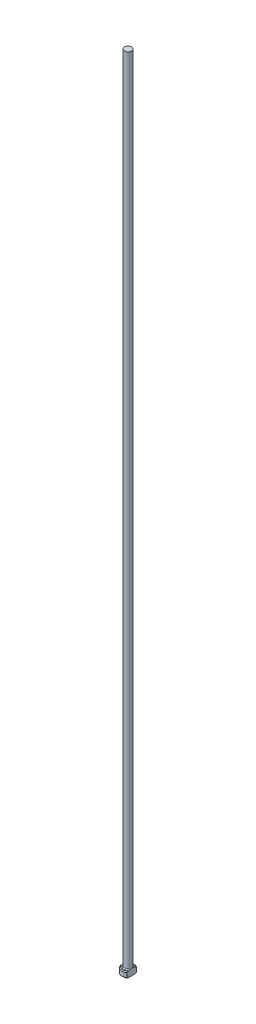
ISO-10303-21;
HEADER;
FILE_DESCRIPTION(('STEP AP214'),'2;1');
FILE_NAME('part.step','',(''),(''),'','','');
FILE_SCHEMA(('AUTOMOTIVE_DESIGN { 1 0 10303 214 1 1 1 1 }'));
ENDSEC;
DATA;
#1=APPLICATION_CONTEXT('core data for automotive mechanical design processes');
#2=APPLICATION_PROTOCOL_DEFINITION('international standard','automotive_design',2000,#1);
#3=PRODUCT_CONTEXT('',#1,'mechanical');
#4=PRODUCT('Part','Part','',(#3));
#5=PRODUCT_RELATED_PRODUCT_CATEGORY('part','',(#4));
#6=PRODUCT_DEFINITION_FORMATION('','',#4);
#7=PRODUCT_DEFINITION_CONTEXT('part definition',#1,'design');
#8=PRODUCT_DEFINITION('design','',#6,#7);
#9=PRODUCT_DEFINITION_SHAPE('','',#8);
#10=(LENGTH_UNIT() NAMED_UNIT(*) SI_UNIT(.MILLI.,.METRE.));
#11=(NAMED_UNIT(*) PLANE_ANGLE_UNIT() SI_UNIT($,.RADIAN.));
#12=(NAMED_UNIT(*) SI_UNIT($,.STERADIAN.) SOLID_ANGLE_UNIT());
#13=UNCERTAINTY_MEASURE_WITH_UNIT(LENGTH_MEASURE(1.E-05),#10,'distance_accuracy_value','');
#14=(GEOMETRIC_REPRESENTATION_CONTEXT(3) GLOBAL_UNCERTAINTY_ASSIGNED_CONTEXT((#13)) GLOBAL_UNIT_ASSIGNED_CONTEXT((#10,
#11,#12)) REPRESENTATION_CONTEXT('',''));
#15=CARTESIAN_POINT('',(0.,0.,0.));
#16=DIRECTION('',(0.,0.,1.));
#17=DIRECTION('',(1.,0.,0.));
#18=AXIS2_PLACEMENT_3D('',#15,#16,#17);
#19=CARTESIAN_POINT('',(0.,0.,0.));
#20=DIRECTION('',(0.,-1.,0.));
#21=DIRECTION('',(0.,0.,-1.));
#22=AXIS2_PLACEMENT_3D('',#19,#20,#21);
#23=PLANE('',#22);
#24=CARTESIAN_POINT('',(0.,0.,0.));
#25=DIRECTION('',(0.,-1.,0.));
#26=DIRECTION('',(0.,0.,-1.));
#27=AXIS2_PLACEMENT_3D('',#24,#25,#26);
#28=CIRCLE('',#27,1.29999999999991);
#29=CARTESIAN_POINT('',(0.899999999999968,0.,0.938083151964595));
#30=VERTEX_POINT('',#29);
#31=CARTESIAN_POINT('',(0.899999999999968,0.,-0.938083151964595));
#32=VERTEX_POINT('',#31);
#33=EDGE_CURVE('E98',#30,#32,#28,.T.);
#34=ORIENTED_EDGE('',*,*,#33,.T.);
#35=DIRECTION('',(0.,0.,1.));
#36=VECTOR('',#35,1.);
#37=CARTESIAN_POINT('',(0.899999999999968,0.,-1.19999999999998));
#38=LINE('',#37,#36);
#39=EDGE_CURVE('E83',#32,#30,#38,.T.);
#40=ORIENTED_EDGE('',*,*,#39,.T.);
#41=EDGE_LOOP('',(#34,#40));
#42=FACE_BOUND('',#41,.T.);
#43=ADVANCED_FACE('F32',(#42),#23,.T.);
#44=CARTESIAN_POINT('',(0.,259.958771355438,0.));
#45=DIRECTION('',(0.,1.,0.));
#46=DIRECTION('',(0.,0.,1.));
#47=AXIS2_PLACEMENT_3D('',#44,#45,#46);
#48=CYLINDRICAL_SURFACE('',#47,1.49999999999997);
#49=CARTESIAN_POINT('',(0.,1.30000000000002,0.));
#50=DIRECTION('',(0.,1.,0.));
#51=DIRECTION('',(0.,0.,1.));
#52=AXIS2_PLACEMENT_3D('',#49,#50,#51);
#53=CIRCLE('',#52,1.49999999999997);
#54=CARTESIAN_POINT('',(0.899999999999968,1.30000000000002,1.19999999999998));
#55=VERTEX_POINT('',#54);
#56=CARTESIAN_POINT('',(0.899999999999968,1.30000000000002,-1.19999999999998));
#57=VERTEX_POINT('',#56);
#58=EDGE_CURVE('E104',#55,#57,#53,.F.);
#59=ORIENTED_EDGE('',*,*,#58,.T.);
#60=DIRECTION('',(0.,-1.,0.));
#61=VECTOR('',#60,1.);
#62=CARTESIAN_POINT('',(0.899999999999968,200.,-1.19999999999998));
#63=LINE('',#62,#61);
#64=CARTESIAN_POINT('',(0.899999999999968,0.200000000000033,-1.19999999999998));
#65=VERTEX_POINT('',#64);
#66=EDGE_CURVE('E183',#57,#65,#63,.T.);
#67=ORIENTED_EDGE('',*,*,#66,.T.);
#68=CARTESIAN_POINT('',(0.,0.200000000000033,0.));
#69=DIRECTION('',(0.,-1.,0.));
#70=DIRECTION('',(0.,0.,-1.));
#71=AXIS2_PLACEMENT_3D('',#68,#69,#70);
#72=CIRCLE('',#71,1.49999999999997);
#73=CARTESIAN_POINT('',(0.899999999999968,0.200000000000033,1.19999999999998));
#74=VERTEX_POINT('',#73);
#75=EDGE_CURVE('E100',#65,#74,#72,.F.);
#76=ORIENTED_EDGE('',*,*,#75,.T.);
#77=DIRECTION('',(0.,-1.,0.));
#78=VECTOR('',#77,1.);
#79=CARTESIAN_POINT('',(0.899999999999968,200.,1.19999999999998));
#80=LINE('',#79,#78);
#81=EDGE_CURVE('E93',#55,#74,#80,.T.);
#82=ORIENTED_EDGE('',*,*,#81,.F.);
#83=EDGE_LOOP('',(#59,#67,#76,#82));
#84=FACE_BOUND('',#83,.T.);
#85=ADVANCED_FACE('F158',(#84),#48,.T.);
#86=CARTESIAN_POINT('',(-1.49999999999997,1.5,0.));
#87=DIRECTION('',(0.,1.,0.));
#88=DIRECTION('',(0.,0.,1.));
#89=AXIS2_PLACEMENT_3D('',#86,#87,#88);
#90=PLANE('',#89);
#91=CARTESIAN_POINT('',(0.,1.5,0.));
#92=DIRECTION('',(0.,1.,0.));
#93=DIRECTION('',(0.,0.,1.));
#94=AXIS2_PLACEMENT_3D('',#91,#92,#93);
#95=CIRCLE('',#94,1.30000000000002);
#96=CARTESIAN_POINT('',(0.899999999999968,1.5,-0.938083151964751));
#97=VERTEX_POINT('',#96);
#98=CARTESIAN_POINT('',(0.899999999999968,1.5,0.938083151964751));
#99=VERTEX_POINT('',#98);
#100=EDGE_CURVE('E178',#97,#99,#95,.T.);
#101=ORIENTED_EDGE('',*,*,#100,.T.);
#102=DIRECTION('',(0.,0.,-1.));
#103=VECTOR('',#102,1.);
#104=CARTESIAN_POINT('',(0.899999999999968,1.5,0.));
#105=LINE('',#104,#103);
#106=CARTESIAN_POINT('',(0.899999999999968,1.49999999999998,0.632455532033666));
#107=VERTEX_POINT('',#106);
#108=EDGE_CURVE('E57',#99,#107,#105,.T.);
#109=ORIENTED_EDGE('',*,*,#108,.T.);
#110=CARTESIAN_POINT('',(0.,1.5,0.));
#111=DIRECTION('',(0.,1.,0.));
#112=DIRECTION('',(0.,0.,1.));
#113=AXIS2_PLACEMENT_3D('',#110,#111,#112);
#114=CIRCLE('',#113,1.09999999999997);
#115=CARTESIAN_POINT('',(0.899999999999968,1.49999999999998,-0.632455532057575));
#116=VERTEX_POINT('',#115);
#117=EDGE_CURVE('E107',#107,#116,#114,.F.);
#118=ORIENTED_EDGE('',*,*,#117,.T.);
#119=EDGE_CURVE('E136',#116,#97,#105,.T.);
#120=ORIENTED_EDGE('',*,*,#119,.T.);
#121=EDGE_LOOP('',(#101,#109,#118,#120));
#122=FACE_BOUND('',#121,.T.);
#123=ADVANCED_FACE('F147',(#122),#90,.T.);
#124=CARTESIAN_POINT('',(0.,1.5,0.));
#125=DIRECTION('',(0.,-1.,0.));
#126=DIRECTION('',(0.,0.,-1.));
#127=AXIS2_PLACEMENT_3D('',#124,#125,#126);
#128=CONICAL_SURFACE('',#127,1.30000000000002,0.785398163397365);
#129=ORIENTED_EDGE('',*,*,#58,.F.);
#130=CARTESIAN_POINT('',(0.899999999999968,0.00589240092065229,2.64519134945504));
#131=CARTESIAN_POINT('',(0.899999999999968,0.0875935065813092,2.55886544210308));
#132=CARTESIAN_POINT('',(0.899999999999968,0.169100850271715,2.47235390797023));
#133=CARTESIAN_POINT('',(0.899999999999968,0.331616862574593,2.29867113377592));
#134=CARTESIAN_POINT('',(0.899999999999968,0.412624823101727,2.21149923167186));
#135=CARTESIAN_POINT('',(0.899999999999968,0.577358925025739,2.03258511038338));
#136=CARTESIAN_POINT('',(0.899999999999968,0.661049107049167,1.94080967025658));
#137=CARTESIAN_POINT('',(0.899999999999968,0.827038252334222,1.75619257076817));
#138=CARTESIAN_POINT('',(0.899999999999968,0.909338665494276,1.66335221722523));
#139=CARTESIAN_POINT('',(0.899999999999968,1.0718306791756,1.47606416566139));
#140=CARTESIAN_POINT('',(0.899999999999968,1.15202519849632,1.38161902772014));
#141=CARTESIAN_POINT('',(0.899999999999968,1.26992152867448,1.23769406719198));
#142=CARTESIAN_POINT('',(0.899999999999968,1.30888905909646,1.18925359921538));
#143=CARTESIAN_POINT('',(0.899999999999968,1.38565831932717,1.09146009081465));
#144=CARTESIAN_POINT('',(0.899999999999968,1.42346015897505,1.0421071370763));
#145=CARTESIAN_POINT('',(0.899999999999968,1.49668885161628,0.943239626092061));
#146=CARTESIAN_POINT('',(0.899999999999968,1.53214870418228,0.893749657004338));
#147=CARTESIAN_POINT('',(0.899999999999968,1.60090132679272,0.793212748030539));
#148=CARTESIAN_POINT('',(0.899999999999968,1.63419242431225,0.74216465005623));
#149=CARTESIAN_POINT('',(0.899999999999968,1.69733745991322,0.638399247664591));
#150=CARTESIAN_POINT('',(0.899999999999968,1.72721157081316,0.585694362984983));
#151=CARTESIAN_POINT('',(0.899999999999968,1.78207526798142,0.477828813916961));
#152=CARTESIAN_POINT('',(0.899999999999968,1.80707433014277,0.4226731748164));
#153=CARTESIAN_POINT('',(0.899999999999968,1.83835305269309,0.339650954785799));
#154=CARTESIAN_POINT('',(0.899999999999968,1.84751725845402,0.312872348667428));
#155=CARTESIAN_POINT('',(0.899999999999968,1.8639099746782,0.258710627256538));
#156=CARTESIAN_POINT('',(0.899999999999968,1.87113784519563,0.231327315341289));
#157=CARTESIAN_POINT('',(0.899999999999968,1.88330445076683,0.176205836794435));
#158=CARTESIAN_POINT('',(0.899999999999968,1.8882553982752,0.148470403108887));
#159=CARTESIAN_POINT('',(0.899999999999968,1.89566404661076,0.0926697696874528));
#160=CARTESIAN_POINT('',(0.899999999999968,1.89812233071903,0.0646046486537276));
#161=CARTESIAN_POINT('',(0.899999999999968,1.90040685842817,0.00817656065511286));
#162=CARTESIAN_POINT('',(0.899999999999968,1.90021541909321,-0.0201871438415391));
#163=CARTESIAN_POINT('',(0.899999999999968,1.89717544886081,-0.0767648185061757));
#164=CARTESIAN_POINT('',(0.899999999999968,1.89432689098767,-0.104978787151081));
#165=CARTESIAN_POINT('',(0.899999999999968,1.88198440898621,-0.18931144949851));
#166=CARTESIAN_POINT('',(0.899999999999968,1.86868632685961,-0.244892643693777));
#167=CARTESIAN_POINT('',(0.899999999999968,1.83784085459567,-0.342756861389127));
#168=CARTESIAN_POINT('',(0.899999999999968,1.82164970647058,-0.385499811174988));
#169=CARTESIAN_POINT('',(0.899999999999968,1.78562895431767,-0.469449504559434));
#170=CARTESIAN_POINT('',(0.899999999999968,1.7657963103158,-0.510654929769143));
#171=CARTESIAN_POINT('',(0.899999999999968,1.72329278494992,-0.592044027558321));
#172=CARTESIAN_POINT('',(0.899999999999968,1.70059692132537,-0.632214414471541));
#173=CARTESIAN_POINT('',(0.899999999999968,1.65325605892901,-0.711354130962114));
#174=CARTESIAN_POINT('',(0.899999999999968,1.62861192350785,-0.750323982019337));
#175=CARTESIAN_POINT('',(0.899999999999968,1.57369928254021,-0.833637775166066));
#176=CARTESIAN_POINT('',(0.899999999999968,1.5431726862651,-0.877810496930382));
#177=CARTESIAN_POINT('',(0.899999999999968,1.48069350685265,-0.965139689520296));
#178=CARTESIAN_POINT('',(0.899999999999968,1.44874066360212,-1.00829597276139));
#179=CARTESIAN_POINT('',(0.899999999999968,1.3512769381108,-1.13662989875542));
#180=CARTESIAN_POINT('',(0.899999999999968,1.28420052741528,-1.22061473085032));
#181=CARTESIAN_POINT('',(0.899999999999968,1.14740677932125,-1.38681927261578));
#182=CARTESIAN_POINT('',(0.899999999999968,1.07768177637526,-1.46903257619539));
#183=CARTESIAN_POINT('',(0.899999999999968,0.936682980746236,-1.63206079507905));
#184=CARTESIAN_POINT('',(0.899999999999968,0.86540980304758,-1.71287624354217));
#185=CARTESIAN_POINT('',(0.899999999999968,0.728966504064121,-1.86553619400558));
#186=CARTESIAN_POINT('',(0.899999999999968,0.663897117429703,-1.93747112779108));
#187=CARTESIAN_POINT('',(0.899999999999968,0.533118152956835,-2.08077158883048));
#188=CARTESIAN_POINT('',(0.899999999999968,0.467408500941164,-2.15213704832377));
#189=CARTESIAN_POINT('',(0.899999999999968,0.335929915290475,-2.29398062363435));
#190=CARTESIAN_POINT('',(0.899999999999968,0.270163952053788,-2.36446149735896));
#191=CARTESIAN_POINT('',(0.899999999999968,0.13827403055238,-2.50506786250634));
#192=CARTESIAN_POINT('',(0.899999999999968,0.0721501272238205,-2.57519340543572));
#193=CARTESIAN_POINT('',(0.899999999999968,0.00589240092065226,-2.64519134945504));
#194=B_SPLINE_CURVE_WITH_KNOTS('',3,(#130,#131,#132,#133,#134,#135,#136,#137,#138,#139,#140,
#141,#142,#143,#144,#145,#146,#147,#148,#149,#150,#151,#152,#153,#154,#155,#156,#157,#158,#159,
#160,#161,#162,#163,#164,#165,#166,#167,#168,#169,#170,#171,#172,#173,#174,#175,#176,#177,#178,
#179,#180,#181,#182,#183,#184,#185,#186,#187,#188,#189,#190,#191,#192,#193),.UNSPECIFIED.,.F.,
.F.,(4,2,2,2,2,2,2,2,2,2,2,2,2,2,2,2,2,2,2,2,2,2,2,2,2,2,2,2,2,2,2,4),(0.,0.356576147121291,
0.713576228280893,1.08618079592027,1.45836906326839,1.83001087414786,2.01650462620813,
2.20298075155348,2.38558873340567,2.56833591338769,2.74994146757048,2.93119042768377,
3.01604159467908,3.10092076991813,3.18533922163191,3.26973791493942,3.35470011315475,
3.43966317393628,3.61026391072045,3.74720161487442,3.88425416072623,4.02259807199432,
4.16088101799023,4.3219249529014,4.48299837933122,4.80535548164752,5.12872978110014,
5.45197789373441,5.74296839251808,6.03399301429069,6.32318782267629,6.61233943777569),.UNSPECIFIED.);
#195=EDGE_CURVE('E135',#55,#99,#194,.T.);
#196=ORIENTED_EDGE('',*,*,#195,.T.);
#197=ORIENTED_EDGE('',*,*,#100,.F.);
#198=EDGE_CURVE('E127',#97,#57,#194,.T.);
#199=ORIENTED_EDGE('',*,*,#198,.T.);
#200=EDGE_LOOP('',(#129,#196,#197,#199));
#201=FACE_BOUND('',#200,.T.);
#202=ADVANCED_FACE('F143',(#201),#128,.T.);
#203=CARTESIAN_POINT('',(0.,0.200000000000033,0.));
#204=DIRECTION('',(0.,1.,0.));
#205=DIRECTION('',(0.,0.,1.));
#206=AXIS2_PLACEMENT_3D('',#203,#204,#205);
#207=CONICAL_SURFACE('',#206,1.49999999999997,0.785398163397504);
#208=ORIENTED_EDGE('',*,*,#75,.F.);
#209=CARTESIAN_POINT('',(0.899999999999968,1.49410759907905,-2.64519134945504));
#210=CARTESIAN_POINT('',(0.899999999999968,1.41240649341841,-2.55886544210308));
#211=CARTESIAN_POINT('',(0.899999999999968,1.33089914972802,-2.47235390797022));
#212=CARTESIAN_POINT('',(0.899999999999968,1.16838313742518,-2.29867113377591));
#213=CARTESIAN_POINT('',(0.899999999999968,1.08737517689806,-2.21149923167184));
#214=CARTESIAN_POINT('',(0.899999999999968,0.922641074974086,-2.03258511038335));
#215=CARTESIAN_POINT('',(0.899999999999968,0.838950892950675,-1.94080967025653));
#216=CARTESIAN_POINT('',(0.899999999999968,0.672961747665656,-1.75619257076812));
#217=CARTESIAN_POINT('',(0.899999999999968,0.59066133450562,-1.66335221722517));
#218=CARTESIAN_POINT('',(0.899999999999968,0.428169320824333,-1.47606416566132));
#219=CARTESIAN_POINT('',(0.899999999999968,0.347974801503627,-1.38161902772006));
#220=CARTESIAN_POINT('',(0.899999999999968,0.230078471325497,-1.23769406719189));
#221=CARTESIAN_POINT('',(0.899999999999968,0.19111094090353,-1.18925359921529));
#222=CARTESIAN_POINT('',(0.899999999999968,0.114341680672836,-1.09146009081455));
#223=CARTESIAN_POINT('',(0.899999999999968,0.076539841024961,-1.04210713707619));
#224=CARTESIAN_POINT('',(0.899999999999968,0.00331114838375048,-0.943239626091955));
#225=CARTESIAN_POINT('',(0.899999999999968,-0.0321487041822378,-0.893749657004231));
#226=CARTESIAN_POINT('',(0.899999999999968,-0.100901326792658,-0.793212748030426));
#227=CARTESIAN_POINT('',(0.899999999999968,-0.134192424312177,-0.742164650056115));
#228=CARTESIAN_POINT('',(0.899999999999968,-0.197337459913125,-0.638399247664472));
#229=CARTESIAN_POINT('',(0.899999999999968,-0.227211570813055,-0.585694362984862));
#230=CARTESIAN_POINT('',(0.899999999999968,-0.282075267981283,-0.477828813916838));
#231=CARTESIAN_POINT('',(0.899999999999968,-0.307074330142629,-0.422673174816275));
#232=CARTESIAN_POINT('',(0.899999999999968,-0.338353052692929,-0.339650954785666));
#233=CARTESIAN_POINT('',(0.899999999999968,-0.347517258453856,-0.312872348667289));
#234=CARTESIAN_POINT('',(0.899999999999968,-0.363909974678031,-0.258710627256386));
#235=CARTESIAN_POINT('',(0.899999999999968,-0.371137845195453,-0.23132731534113));
#236=CARTESIAN_POINT('',(0.899999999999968,-0.38330445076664,-0.176205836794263));
#237=CARTESIAN_POINT('',(0.899999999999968,-0.388255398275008,-0.148470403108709));
#238=CARTESIAN_POINT('',(0.899999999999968,-0.39566404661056,-0.0926697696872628));
#239=CARTESIAN_POINT('',(0.899999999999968,-0.398122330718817,-0.0646046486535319));
#240=CARTESIAN_POINT('',(0.899999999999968,-0.400406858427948,-0.00817656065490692));
#241=CARTESIAN_POINT('',(0.899999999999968,-0.400215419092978,0.0201871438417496));
#242=CARTESIAN_POINT('',(0.899999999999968,-0.39717544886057,0.0767648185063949));
#243=CARTESIAN_POINT('',(0.899999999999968,-0.394326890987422,0.104978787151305));
#244=CARTESIAN_POINT('',(0.899999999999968,-0.381984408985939,0.189311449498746));
#245=CARTESIAN_POINT('',(0.899999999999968,-0.368686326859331,0.244892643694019));
#246=CARTESIAN_POINT('',(0.899999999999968,-0.33784085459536,0.342756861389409));
#247=CARTESIAN_POINT('',(0.899999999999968,-0.321649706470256,0.385499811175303));
#248=CARTESIAN_POINT('',(0.899999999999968,-0.285628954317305,0.46944950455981));
#249=CARTESIAN_POINT('',(0.899999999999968,-0.265796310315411,0.510654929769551));
#250=CARTESIAN_POINT('',(0.899999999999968,-0.223292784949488,0.592044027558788));
#251=CARTESIAN_POINT('',(0.899999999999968,-0.200596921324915,0.632214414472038));
#252=CARTESIAN_POINT('',(0.899999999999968,-0.153256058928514,0.711354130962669));
#253=CARTESIAN_POINT('',(0.899999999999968,-0.128611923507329,0.750323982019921));
#254=CARTESIAN_POINT('',(0.899999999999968,-0.073699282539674,0.833637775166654));
#255=CARTESIAN_POINT('',(0.899999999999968,-0.0431726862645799,0.877810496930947));
#256=CARTESIAN_POINT('',(0.899999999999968,0.0193064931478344,0.965139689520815));
#257=CARTESIAN_POINT('',(0.899999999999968,0.0512593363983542,1.00829597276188));
#258=CARTESIAN_POINT('',(0.899999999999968,0.148723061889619,1.13662989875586));
#259=CARTESIAN_POINT('',(0.899999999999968,0.215799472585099,1.22061473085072));
#260=CARTESIAN_POINT('',(0.899999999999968,0.352593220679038,1.3868192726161));
#261=CARTESIAN_POINT('',(0.899999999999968,0.42231822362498,1.46903257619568));
#262=CARTESIAN_POINT('',(0.899999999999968,0.563317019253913,1.63206079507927));
#263=CARTESIAN_POINT('',(0.899999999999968,0.634590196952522,1.71287624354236));
#264=CARTESIAN_POINT('',(0.899999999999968,0.771033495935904,1.86553619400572));
#265=CARTESIAN_POINT('',(0.899999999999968,0.836102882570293,1.9374711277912));
#266=CARTESIAN_POINT('',(0.899999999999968,0.966881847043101,2.08077158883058));
#267=CARTESIAN_POINT('',(0.899999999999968,1.03259149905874,2.15213704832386));
#268=CARTESIAN_POINT('',(0.899999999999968,1.16407008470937,2.29398062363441));
#269=CARTESIAN_POINT('',(0.899999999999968,1.22983604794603,2.364461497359));
#270=CARTESIAN_POINT('',(0.899999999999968,1.36172596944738,2.50506786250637));
#271=CARTESIAN_POINT('',(0.899999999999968,1.42784987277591,2.57519340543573));
#272=CARTESIAN_POINT('',(0.899999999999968,1.49410759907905,2.64519134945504));
#273=B_SPLINE_CURVE_WITH_KNOTS('',3,(#209,#210,#211,#212,#213,#214,#215,#216,#217,#218,#219,
#220,#221,#222,#223,#224,#225,#226,#227,#228,#229,#230,#231,#232,#233,#234,#235,#236,#237,#238,
#239,#240,#241,#242,#243,#244,#245,#246,#247,#248,#249,#250,#251,#252,#253,#254,#255,#256,#257,
#258,#259,#260,#261,#262,#263,#264,#265,#266,#267,#268,#269,#270,#271,#272),.UNSPECIFIED.,.F.,
.F.,(4,2,2,2,2,2,2,2,2,2,2,2,2,2,2,2,2,2,2,2,2,2,2,2,2,2,2,2,2,2,2,4),(0.,0.356576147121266,
0.713576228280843,1.08618079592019,1.45836906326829,1.83001087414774,2.01650462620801,
2.20298075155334,2.38558873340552,2.56833591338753,2.74994146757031,2.93119042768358,
3.01604159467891,3.10092076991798,3.18533922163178,3.2697379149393,3.35470011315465,
3.43966317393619,3.61026391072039,3.74720161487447,3.88425416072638,4.02259807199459,
4.16088101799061,4.3219249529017,4.48299837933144,4.80535548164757,5.12872978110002,
5.45197789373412,5.7429683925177,6.03399301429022,6.32318782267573,6.61233943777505),.UNSPECIFIED.);
#274=EDGE_CURVE('E86',#65,#32,#273,.T.);
#275=ORIENTED_EDGE('',*,*,#274,.T.);
#276=ORIENTED_EDGE('',*,*,#33,.F.);
#277=EDGE_CURVE('E89',#30,#74,#273,.T.);
#278=ORIENTED_EDGE('',*,*,#277,.T.);
#279=EDGE_LOOP('',(#208,#275,#276,#278));
#280=FACE_BOUND('',#279,.T.);
#281=ADVANCED_FACE('F97',(#280),#207,.T.);
#282=CARTESIAN_POINT('',(0.,1.69999999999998,0.));
#283=DIRECTION('',(0.,1.,0.));
#284=DIRECTION('',(0.,0.,1.));
#285=AXIS2_PLACEMENT_3D('',#282,#283,#284);
#286=TOROIDAL_SURFACE('',#285,1.09999999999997,0.2);
#287=CARTESIAN_POINT('',(0.899999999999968,1.69999999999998,0.));
#288=CARTESIAN_POINT('',(0.899999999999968,1.70000051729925,-4.81752855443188E-12));
#289=CARTESIAN_POINT('',(0.899999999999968,1.70000103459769,-8.83853827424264E-08));
#290=CARTESIAN_POINT('',(0.899999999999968,1.70000203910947,-3.79347123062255E-07));
#291=CARTESIAN_POINT('',(0.899999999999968,1.70000252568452,-5.83791020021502E-07));
#292=CARTESIAN_POINT('',(0.899999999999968,1.70000349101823,-1.07888050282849E-06));
#293=CARTESIAN_POINT('',(0.899999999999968,1.70000396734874,-1.37414928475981E-06));
#294=CARTESIAN_POINT('',(0.899999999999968,1.70000487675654,-2.01876645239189E-06));
#295=CARTESIAN_POINT('',(0.899999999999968,1.70000531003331,-2.36784425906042E-06));
#296=CARTESIAN_POINT('',(0.899999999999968,1.70000672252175,-3.59471376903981E-06));
#297=CARTESIAN_POINT('',(0.899999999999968,1.70000764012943,-4.54411385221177E-06));
#298=CARTESIAN_POINT('',(0.899999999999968,1.70000930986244,-6.53225285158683E-06));
#299=CARTESIAN_POINT('',(0.899999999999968,1.70001006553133,-7.56818772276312E-06));
#300=CARTESIAN_POINT('',(0.899999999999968,1.70001280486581,-1.1504277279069E-05));
#301=CARTESIAN_POINT('',(0.899999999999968,1.70001463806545,-1.45126261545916E-05));
#302=CARTESIAN_POINT('',(0.899999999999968,1.70001772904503,-2.0529366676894E-05));
#303=CARTESIAN_POINT('',(0.899999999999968,1.7000190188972,-2.35219566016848E-05));
#304=CARTESIAN_POINT('',(0.899999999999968,1.70002431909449,-3.59579086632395E-05));
#305=CARTESIAN_POINT('',(0.899999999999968,1.70002821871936,-4.5443001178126E-05));
#306=CARTESIAN_POINT('',(0.899999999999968,1.70003465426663,-6.33834857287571E-05));
#307=CARTESIAN_POINT('',(0.899999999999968,1.70003730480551,-7.17963379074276E-05));
#308=CARTESIAN_POINT('',(0.899999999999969,1.7000577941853,-0.000131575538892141));
#309=CARTESIAN_POINT('',(0.899999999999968,1.70008325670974,-0.000179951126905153));
#310=CARTESIAN_POINT('',(0.899999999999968,1.70017756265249,-0.000366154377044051));
#311=CARTESIAN_POINT('',(0.899999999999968,1.70024074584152,-0.000506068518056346));
#312=CARTESIAN_POINT('',(0.899999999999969,1.70048673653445,-0.00104250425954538));
#313=CARTESIAN_POINT('',(0.899999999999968,1.70067547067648,-0.00143687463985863));
#314=CARTESIAN_POINT('',(0.899999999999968,1.70143326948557,-0.00302835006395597));
#315=CARTESIAN_POINT('',(0.899999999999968,1.70199567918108,-0.004227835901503));
#316=CARTESIAN_POINT('',(0.899999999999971,1.71027509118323,-0.0218760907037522));
#317=CARTESIAN_POINT('',(0.899999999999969,1.71804211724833,-0.0383074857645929));
#318=CARTESIAN_POINT('',(0.899999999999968,1.73319280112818,-0.070653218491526));
#319=CARTESIAN_POINT('',(0.899999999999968,1.740580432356,-0.0865658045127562));
#320=CARTESIAN_POINT('',(0.899999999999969,1.75601133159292,-0.120208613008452));
#321=CARTESIAN_POINT('',(0.899999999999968,1.76403763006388,-0.137946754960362));
#322=CARTESIAN_POINT('',(0.899999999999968,1.77987044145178,-0.173723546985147));
#323=CARTESIAN_POINT('',(0.899999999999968,1.78767412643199,-0.19176344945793));
#324=CARTESIAN_POINT('',(0.899999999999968,1.80675241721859,-0.237275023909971));
#325=CARTESIAN_POINT('',(0.899999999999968,1.81776430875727,-0.2648584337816));
#326=CARTESIAN_POINT('',(0.899999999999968,1.83819603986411,-0.319948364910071));
#327=CARTESIAN_POINT('',(0.899999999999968,1.84764487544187,-0.347443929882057));
#328=CARTESIAN_POINT('',(0.899999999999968,1.86148320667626,-0.392411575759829));
#329=CARTESIAN_POINT('',(0.899999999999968,1.86642863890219,-0.409710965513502));
#330=CARTESIAN_POINT('',(0.899999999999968,1.8755120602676,-0.444608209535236));
#331=CARTESIAN_POINT('',(0.899999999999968,1.87964591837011,-0.462207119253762));
#332=CARTESIAN_POINT('',(0.899999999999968,1.89092217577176,-0.517069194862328));
#333=CARTESIAN_POINT('',(0.899999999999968,1.89638973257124,-0.554723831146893));
#334=CARTESIAN_POINT('',(0.899999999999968,1.90033616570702,-0.618345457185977));
#335=CARTESIAN_POINT('',(0.899999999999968,1.90048945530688,-0.644204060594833));
#336=CARTESIAN_POINT('',(0.899999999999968,1.89710720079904,-0.695408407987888));
#337=CARTESIAN_POINT('',(0.899999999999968,1.89361956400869,-0.720756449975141));
#338=CARTESIAN_POINT('',(0.899999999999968,1.8840925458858,-0.761575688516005));
#339=CARTESIAN_POINT('',(0.899999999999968,1.87939871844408,-0.77735842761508));
#340=CARTESIAN_POINT('',(0.899999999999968,1.8677590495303,-0.808125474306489));
#341=CARTESIAN_POINT('',(0.899999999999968,1.86081090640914,-0.82310894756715));
#342=CARTESIAN_POINT('',(0.899999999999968,1.84643118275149,-0.84802158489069));
#343=CARTESIAN_POINT('',(0.899999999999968,1.83956190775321,-0.858273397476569));
#344=CARTESIAN_POINT('',(0.899999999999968,1.82429709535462,-0.877569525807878));
#345=CARTESIAN_POINT('',(0.899999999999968,1.81590447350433,-0.886616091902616));
#346=CARTESIAN_POINT('',(0.899999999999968,1.79958050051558,-0.90122933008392));
#347=CARTESIAN_POINT('',(0.899999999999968,1.79194496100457,-0.907125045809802));
#348=CARTESIAN_POINT('',(0.899999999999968,1.77580769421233,-0.917595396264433));
#349=CARTESIAN_POINT('',(0.899999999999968,1.76730630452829,-0.922170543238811));
#350=CARTESIAN_POINT('',(0.899999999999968,1.74953707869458,-0.929743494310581));
#351=CARTESIAN_POINT('',(0.899999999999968,1.7402636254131,-0.932728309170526));
#352=CARTESIAN_POINT('',(0.899999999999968,1.72131152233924,-0.936825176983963));
#353=CARTESIAN_POINT('',(0.899999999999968,1.71163321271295,-0.937938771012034));
#354=CARTESIAN_POINT('',(0.899999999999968,1.69353224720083,-0.938184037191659));
#355=CARTESIAN_POINT('',(0.899999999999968,1.68511203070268,-0.937557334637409));
#356=CARTESIAN_POINT('',(0.899999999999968,1.66850650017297,-0.934868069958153));
#357=CARTESIAN_POINT('',(0.899999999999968,1.66032116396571,-0.932805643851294));
#358=CARTESIAN_POINT('',(0.899999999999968,1.64454784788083,-0.927423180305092));
#359=CARTESIAN_POINT('',(0.899999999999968,1.63695168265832,-0.924126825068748));
#360=CARTESIAN_POINT('',(0.899999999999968,1.62233604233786,-0.916445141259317));
#361=CARTESIAN_POINT('',(0.899999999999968,1.61531677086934,-0.912059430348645));
#362=CARTESIAN_POINT('',(0.899999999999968,1.59928568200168,-0.90046071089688));
#363=CARTESIAN_POINT('',(0.899999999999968,1.59058572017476,-0.892815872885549));
#364=CARTESIAN_POINT('',(0.899999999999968,1.5745385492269,-0.876213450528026));
#365=CARTESIAN_POINT('',(0.899999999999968,1.56719456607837,-0.867252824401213));
#366=CARTESIAN_POINT('',(0.899999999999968,1.55118133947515,-0.84466452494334));
#367=CARTESIAN_POINT('',(0.899999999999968,1.54313909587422,-0.830593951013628));
#368=CARTESIAN_POINT('',(0.899999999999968,1.52938683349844,-0.801407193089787));
#369=CARTESIAN_POINT('',(0.899999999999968,1.5236756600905,-0.786291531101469));
#370=CARTESIAN_POINT('',(0.899999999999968,1.51172911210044,-0.74718638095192));
#371=CARTESIAN_POINT('',(0.899999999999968,1.50685445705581,-0.722784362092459));
#372=CARTESIAN_POINT('',(0.899999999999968,1.50081074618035,-0.673272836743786));
#373=CARTESIAN_POINT('',(0.899999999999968,1.49969151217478,-0.648158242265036));
#374=CARTESIAN_POINT('',(0.899999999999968,1.50075906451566,-0.577783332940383));
#375=CARTESIAN_POINT('',(0.899999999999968,1.50633248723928,-0.532580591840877));
#376=CARTESIAN_POINT('',(0.899999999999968,1.51921661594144,-0.466989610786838));
#377=CARTESIAN_POINT('',(0.899999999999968,1.52408424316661,-0.446017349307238));
#378=CARTESIAN_POINT('',(0.899999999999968,1.53497010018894,-0.404492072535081));
#379=CARTESIAN_POINT('',(0.899999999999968,1.54098157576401,-0.383937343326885));
#380=CARTESIAN_POINT('',(0.899999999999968,1.55597324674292,-0.336733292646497));
#381=CARTESIAN_POINT('',(0.899999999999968,1.56529325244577,-0.31019400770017));
#382=CARTESIAN_POINT('',(0.899999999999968,1.58534056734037,-0.256981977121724));
#383=CARTESIAN_POINT('',(0.899999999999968,1.59609461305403,-0.230319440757));
#384=CARTESIAN_POINT('',(0.899999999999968,1.61469335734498,-0.186260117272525));
#385=CARTESIAN_POINT('',(0.899999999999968,1.62230075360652,-0.168761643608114));
#386=CARTESIAN_POINT('',(0.899999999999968,1.63771739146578,-0.134051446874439));
#387=CARTESIAN_POINT('',(0.899999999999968,1.64552404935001,-0.11683857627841));
#388=CARTESIAN_POINT('',(0.899999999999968,1.66052241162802,-0.0841876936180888));
#389=CARTESIAN_POINT('',(0.899999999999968,1.66769861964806,-0.068742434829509));
#390=CARTESIAN_POINT('',(0.899999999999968,1.68241091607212,-0.0373451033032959));
#391=CARTESIAN_POINT('',(0.899999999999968,1.68995069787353,-0.0213946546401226));
#392=CARTESIAN_POINT('',(0.899999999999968,1.69800429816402,-0.00422789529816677));
#393=CARTESIAN_POINT('',(0.899999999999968,1.6985666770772,-0.00302846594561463));
#394=CARTESIAN_POINT('',(0.899999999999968,1.69932446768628,-0.00143700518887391));
#395=CARTESIAN_POINT('',(0.899999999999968,1.69951322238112,-0.001042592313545));
#396=CARTESIAN_POINT('',(0.899999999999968,1.69975923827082,-0.0005061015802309));
#397=CARTESIAN_POINT('',(0.899999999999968,1.69982242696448,-0.00036617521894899));
#398=CARTESIAN_POINT('',(0.899999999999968,1.69991674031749,-0.000179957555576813));
#399=CARTESIAN_POINT('',(0.899999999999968,1.69994220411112,-0.000131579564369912));
#400=CARTESIAN_POINT('',(0.899999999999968,1.69996269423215,-7.17975508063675E-05));
#401=CARTESIAN_POINT('',(0.899999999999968,1.69996534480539,-6.33844949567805E-05));
#402=CARTESIAN_POINT('',(0.899999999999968,1.69997178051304,-4.54435728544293E-05));
#403=CARTESIAN_POINT('',(0.899999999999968,1.69997568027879,-3.59582518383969E-05));
#404=CARTESIAN_POINT('',(0.899999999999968,1.69998098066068,-2.35220424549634E-05));
#405=CARTESIAN_POINT('',(0.899999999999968,1.69998227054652,-2.05294182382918E-05));
#406=CARTESIAN_POINT('',(0.899999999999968,1.69998536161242,-1.45126147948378E-05));
#407=CARTESIAN_POINT('',(0.899999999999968,1.69998719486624,-1.15042383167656E-05));
#408=CARTESIAN_POINT('',(0.899999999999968,1.69998993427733,-7.56812363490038E-06));
#409=CARTESIAN_POINT('',(0.899999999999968,1.69999068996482,-6.53218593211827E-06));
#410=CARTESIAN_POINT('',(0.899999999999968,1.69999235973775,-4.54404507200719E-06));
#411=CARTESIAN_POINT('',(0.899999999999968,1.69999327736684,-3.59464609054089E-06));
#412=CARTESIAN_POINT('',(0.899999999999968,1.69999468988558,-2.367782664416E-06));
#413=CARTESIAN_POINT('',(0.899999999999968,1.69999512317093,-2.0187075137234E-06));
#414=CARTESIAN_POINT('',(0.899999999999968,1.6999960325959,-1.37409717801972E-06));
#415=CARTESIAN_POINT('',(0.899999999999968,1.69999650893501,-1.07883258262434E-06));
#416=CARTESIAN_POINT('',(0.899999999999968,1.69999747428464,-5.83753284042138E-07));
#417=CARTESIAN_POINT('',(0.899999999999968,1.69999796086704,-3.79315230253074E-07));
#418=CARTESIAN_POINT('',(0.899999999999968,1.69999896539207,-8.83675723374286E-08));
#419=CARTESIAN_POINT('',(0.899999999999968,1.69999948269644,4.81756834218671E-12));
#420=CARTESIAN_POINT('',(0.899999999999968,1.69999999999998,0.));
#421=B_SPLINE_CURVE_WITH_KNOTS('',3,(#287,#288,#289,#290,#291,#292,#293,#294,#295,#296,#297,
#298,#299,#300,#301,#302,#303,#304,#305,#306,#307,#308,#309,#310,#311,#312,#313,#314,#315,#316,
#317,#318,#319,#320,#321,#322,#323,#324,#325,#326,#327,#328,#329,#330,#331,#332,#333,#334,#335,
#336,#337,#338,#339,#340,#341,#342,#343,#344,#345,#346,#347,#348,#349,#350,#351,#352,#353,#354,
#355,#356,#357,#358,#359,#360,#361,#362,#363,#364,#365,#366,#367,#368,#369,#370,#371,#372,#373,
#374,#375,#376,#377,#378,#379,#380,#381,#382,#383,#384,#385,#386,#387,#388,#389,#390,#391,#392,
#393,#394,#395,#396,#397,#398,#399,#400,#401,#402,#403,#404,#405,#406,#407,#408,#409,#410,#411,
#412,#413,#414,#415,#416,#417,#418,#419,#420),.UNSPECIFIED.,.T.,.F.,(4,2,2,2,2,2,2,2,2,2,2,2,2,
2,2,2,2,2,2,2,2,2,2,2,2,2,2,2,2,2,2,2,2,2,2,2,2,2,2,2,2,2,2,2,2,2,2,2,2,2,2,2,2,2,2,2,2,2,2,2,2,
2,2,2,2,2,4),(0.,1.55029814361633E-06,3.12621066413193E-06,4.80150809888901E-06,
6.46864070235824E-06,1.04101337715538E-05,1.42537471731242E-05,2.4783374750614E-05,
3.45499426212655E-05,6.53057747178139E-05,9.17408886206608E-05,0.000254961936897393,
0.000716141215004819,0.00202698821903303,0.00600215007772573,0.0605188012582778,
0.113151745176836,0.171557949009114,0.230521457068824,0.319597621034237,0.406770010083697,
0.460726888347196,0.514951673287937,0.628665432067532,0.706058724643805,0.782446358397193,
0.831714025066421,0.881032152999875,0.917931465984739,0.954760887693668,0.983590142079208,
1.01240819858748,1.04145815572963,1.07048417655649,1.09568882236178,1.12089108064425,
1.14563256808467,1.17038275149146,1.20493518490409,1.23956879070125,1.28791845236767,
1.33624413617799,1.41048010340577,1.485697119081,1.6214638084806,1.68604551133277,1.75025708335,
1.83460395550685,1.92083077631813,1.97807032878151,2.03476947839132,2.08586372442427,
2.13878481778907,2.14275978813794,2.14407077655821,2.14453199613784,2.14469522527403,
2.14472166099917,2.14475241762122,2.14476218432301,2.14477271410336,2.14477655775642,
2.14478049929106,2.14478216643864,2.14478384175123,2.1447854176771,2.14478696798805),.UNSPECIFIED.);
#422=CARTESIAN_POINT('',(0.899999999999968,1.69999999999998,0.));
#423=VERTEX_POINT('',#422);
#424=EDGE_CURVE('E11',#116,#423,#421,.T.);
#425=ORIENTED_EDGE('',*,*,#424,.F.);
#426=ORIENTED_EDGE('',*,*,#117,.F.);
#427=CARTESIAN_POINT('',(0.899999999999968,1.69999999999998,0.));
#428=CARTESIAN_POINT('',(0.899999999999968,1.69999948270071,4.81751337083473E-12));
#429=CARTESIAN_POINT('',(0.899999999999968,1.69999896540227,8.8385382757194E-08));
#430=CARTESIAN_POINT('',(0.899999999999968,1.69999796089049,3.79347123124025E-07));
#431=CARTESIAN_POINT('',(0.899999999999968,1.69999747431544,5.83791020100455E-07));
#432=CARTESIAN_POINT('',(0.899999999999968,1.69999650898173,1.07888050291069E-06));
#433=CARTESIAN_POINT('',(0.899999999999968,1.69999603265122,1.3741492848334E-06));
#434=CARTESIAN_POINT('',(0.899999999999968,1.69999512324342,2.01876645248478E-06));
#435=CARTESIAN_POINT('',(0.899999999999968,1.69999468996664,2.36784425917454E-06));
#436=CARTESIAN_POINT('',(0.899999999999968,1.69999327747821,3.59471376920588E-06));
#437=CARTESIAN_POINT('',(0.899999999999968,1.69999235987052,4.54411385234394E-06));
#438=CARTESIAN_POINT('',(0.899999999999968,1.69999069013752,6.53225285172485E-06));
#439=CARTESIAN_POINT('',(0.899999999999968,1.69998993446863,7.5681877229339E-06));
#440=CARTESIAN_POINT('',(0.899999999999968,1.69998719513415,1.15042772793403E-05));
#441=CARTESIAN_POINT('',(0.899999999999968,1.69998536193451,1.45126261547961E-05));
#442=CARTESIAN_POINT('',(0.899999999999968,1.69998227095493,2.05293666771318E-05));
#443=CARTESIAN_POINT('',(0.899999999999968,1.69998098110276,2.35219566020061E-05));
#444=CARTESIAN_POINT('',(0.899999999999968,1.69997568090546,3.59579086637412E-05));
#445=CARTESIAN_POINT('',(0.899999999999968,1.6999717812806,4.54430011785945E-05));
#446=CARTESIAN_POINT('',(0.899999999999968,1.69996534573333,6.33834857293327E-05));
#447=CARTESIAN_POINT('',(0.899999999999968,1.69996269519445,7.17963379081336E-05));
#448=CARTESIAN_POINT('',(0.899999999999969,1.69994220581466,0.000131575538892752));
#449=CARTESIAN_POINT('',(0.899999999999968,1.69991674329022,0.000179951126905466));
#450=CARTESIAN_POINT('',(0.899999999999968,1.69982243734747,0.000366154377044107));
#451=CARTESIAN_POINT('',(0.899999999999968,1.69975925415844,0.000506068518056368));
#452=CARTESIAN_POINT('',(0.899999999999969,1.69951326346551,0.00104250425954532));
#453=CARTESIAN_POINT('',(0.899999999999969,1.69932452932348,0.00143687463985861));
#454=CARTESIAN_POINT('',(0.899999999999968,1.69856673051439,0.00302835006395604));
#455=CARTESIAN_POINT('',(0.899999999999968,1.69800432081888,0.00422783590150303));
#456=CARTESIAN_POINT('',(0.899999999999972,1.68972490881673,0.0218760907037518));
#457=CARTESIAN_POINT('',(0.899999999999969,1.68195788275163,0.0383074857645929));
#458=CARTESIAN_POINT('',(0.899999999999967,1.66680719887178,0.0706532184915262));
#459=CARTESIAN_POINT('',(0.899999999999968,1.65941956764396,0.0865658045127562));
#460=CARTESIAN_POINT('',(0.899999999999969,1.64398866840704,0.120208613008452));
#461=CARTESIAN_POINT('',(0.899999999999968,1.63596236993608,0.137946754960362));
#462=CARTESIAN_POINT('',(0.899999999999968,1.62012955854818,0.173723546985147));
#463=CARTESIAN_POINT('',(0.899999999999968,1.61232587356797,0.19176344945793));
#464=CARTESIAN_POINT('',(0.899999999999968,1.59324758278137,0.237275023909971));
#465=CARTESIAN_POINT('',(0.899999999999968,1.58223569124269,0.2648584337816));
#466=CARTESIAN_POINT('',(0.899999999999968,1.56180396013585,0.319948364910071));
#467=CARTESIAN_POINT('',(0.899999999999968,1.55235512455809,0.347443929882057));
#468=CARTESIAN_POINT('',(0.899999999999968,1.5385167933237,0.392411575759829));
#469=CARTESIAN_POINT('',(0.899999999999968,1.53357136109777,0.409710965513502));
#470=CARTESIAN_POINT('',(0.899999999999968,1.52448793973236,0.444608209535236));
#471=CARTESIAN_POINT('',(0.899999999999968,1.52035408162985,0.462207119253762));
#472=CARTESIAN_POINT('',(0.899999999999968,1.5090778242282,0.517069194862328));
#473=CARTESIAN_POINT('',(0.899999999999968,1.50361026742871,0.554723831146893));
#474=CARTESIAN_POINT('',(0.899999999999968,1.49966383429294,0.618345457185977));
#475=CARTESIAN_POINT('',(0.899999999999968,1.49951054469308,0.644204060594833));
#476=CARTESIAN_POINT('',(0.899999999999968,1.50289279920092,0.695408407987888));
#477=CARTESIAN_POINT('',(0.899999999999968,1.50638043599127,0.720756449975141));
#478=CARTESIAN_POINT('',(0.899999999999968,1.51590745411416,0.761575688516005));
#479=CARTESIAN_POINT('',(0.899999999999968,1.52060128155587,0.77735842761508));
#480=CARTESIAN_POINT('',(0.899999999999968,1.53224095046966,0.808125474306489));
#481=CARTESIAN_POINT('',(0.899999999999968,1.53918909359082,0.82310894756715));
#482=CARTESIAN_POINT('',(0.899999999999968,1.55356881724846,0.84802158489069));
#483=CARTESIAN_POINT('',(0.899999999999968,1.56043809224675,0.858273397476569));
#484=CARTESIAN_POINT('',(0.899999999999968,1.57570290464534,0.877569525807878));
#485=CARTESIAN_POINT('',(0.899999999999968,1.58409552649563,0.886616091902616));
#486=CARTESIAN_POINT('',(0.899999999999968,1.60041949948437,0.90122933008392));
#487=CARTESIAN_POINT('',(0.899999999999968,1.60805503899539,0.907125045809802));
#488=CARTESIAN_POINT('',(0.899999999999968,1.62419230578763,0.917595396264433));
#489=CARTESIAN_POINT('',(0.899999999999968,1.63269369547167,0.922170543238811));
#490=CARTESIAN_POINT('',(0.899999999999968,1.65046292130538,0.929743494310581));
#491=CARTESIAN_POINT('',(0.899999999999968,1.65973637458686,0.932728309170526));
#492=CARTESIAN_POINT('',(0.899999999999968,1.67868847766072,0.936825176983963));
#493=CARTESIAN_POINT('',(0.899999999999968,1.68836678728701,0.937938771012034));
#494=CARTESIAN_POINT('',(0.899999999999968,1.70646775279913,0.938184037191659));
#495=CARTESIAN_POINT('',(0.899999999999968,1.71488796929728,0.937557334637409));
#496=CARTESIAN_POINT('',(0.899999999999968,1.73149349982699,0.934868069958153));
#497=CARTESIAN_POINT('',(0.899999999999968,1.73967883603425,0.932805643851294));
#498=CARTESIAN_POINT('',(0.899999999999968,1.75545215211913,0.927423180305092));
#499=CARTESIAN_POINT('',(0.899999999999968,1.76304831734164,0.924126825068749));
#500=CARTESIAN_POINT('',(0.899999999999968,1.77766395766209,0.916445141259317));
#501=CARTESIAN_POINT('',(0.899999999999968,1.78468322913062,0.912059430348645));
#502=CARTESIAN_POINT('',(0.899999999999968,1.80071431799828,0.90046071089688));
#503=CARTESIAN_POINT('',(0.899999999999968,1.8094142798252,0.892815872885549));
#504=CARTESIAN_POINT('',(0.899999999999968,1.82546145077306,0.876213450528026));
#505=CARTESIAN_POINT('',(0.899999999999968,1.83280543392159,0.867252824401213));
#506=CARTESIAN_POINT('',(0.899999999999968,1.84881866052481,0.84466452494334));
#507=CARTESIAN_POINT('',(0.899999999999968,1.85686090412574,0.830593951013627));
#508=CARTESIAN_POINT('',(0.899999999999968,1.87061316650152,0.801407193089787));
#509=CARTESIAN_POINT('',(0.899999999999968,1.87632433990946,0.786291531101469));
#510=CARTESIAN_POINT('',(0.899999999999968,1.88827088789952,0.74718638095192));
#511=CARTESIAN_POINT('',(0.899999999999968,1.89314554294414,0.722784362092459));
#512=CARTESIAN_POINT('',(0.899999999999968,1.89918925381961,0.673272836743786));
#513=CARTESIAN_POINT('',(0.899999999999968,1.90030848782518,0.648158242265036));
#514=CARTESIAN_POINT('',(0.899999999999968,1.8992409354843,0.577783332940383));
#515=CARTESIAN_POINT('',(0.899999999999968,1.89366751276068,0.532580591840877));
#516=CARTESIAN_POINT('',(0.899999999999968,1.88078338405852,0.466989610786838));
#517=CARTESIAN_POINT('',(0.899999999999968,1.87591575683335,0.446017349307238));
#518=CARTESIAN_POINT('',(0.899999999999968,1.86502989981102,0.404492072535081));
#519=CARTESIAN_POINT('',(0.899999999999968,1.85901842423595,0.383937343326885));
#520=CARTESIAN_POINT('',(0.899999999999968,1.84402675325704,0.336733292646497));
#521=CARTESIAN_POINT('',(0.899999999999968,1.83470674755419,0.31019400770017));
#522=CARTESIAN_POINT('',(0.899999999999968,1.81465943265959,0.256981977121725));
#523=CARTESIAN_POINT('',(0.899999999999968,1.80390538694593,0.230319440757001));
#524=CARTESIAN_POINT('',(0.899999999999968,1.78530664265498,0.186260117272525));
#525=CARTESIAN_POINT('',(0.899999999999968,1.77769924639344,0.168761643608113));
#526=CARTESIAN_POINT('',(0.899999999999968,1.76228260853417,0.134051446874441));
#527=CARTESIAN_POINT('',(0.899999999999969,1.75447595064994,0.116838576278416));
#528=CARTESIAN_POINT('',(0.899999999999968,1.73947758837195,0.0841876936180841));
#529=CARTESIAN_POINT('',(0.899999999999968,1.73230138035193,0.0687424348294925));
#530=CARTESIAN_POINT('',(0.899999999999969,1.71758908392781,0.0373451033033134));
#531=CARTESIAN_POINT('',(0.899999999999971,1.71004930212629,0.0213946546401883));
#532=CARTESIAN_POINT('',(0.899999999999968,1.70199570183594,0.00422789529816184));
#533=CARTESIAN_POINT('',(0.899999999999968,1.70143332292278,0.00302846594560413));
#534=CARTESIAN_POINT('',(0.899999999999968,1.70067553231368,0.00143700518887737));
#535=CARTESIAN_POINT('',(0.899999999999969,1.70048677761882,0.00104259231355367));
#536=CARTESIAN_POINT('',(0.899999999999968,1.70024076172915,0.000506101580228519));
#537=CARTESIAN_POINT('',(0.899999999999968,1.7001775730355,0.000366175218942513));
#538=CARTESIAN_POINT('',(0.899999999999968,1.70008325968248,0.000179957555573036));
#539=CARTESIAN_POINT('',(0.899999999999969,1.70005779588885,0.000131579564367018));
#540=CARTESIAN_POINT('',(0.899999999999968,1.70003730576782,7.17975508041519E-05));
#541=CARTESIAN_POINT('',(0.899999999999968,1.70003465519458,6.3384494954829E-05));
#542=CARTESIAN_POINT('',(0.899999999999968,1.70002821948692,4.54435728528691E-05));
#543=CARTESIAN_POINT('',(0.899999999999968,1.70002431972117,3.59582518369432E-05));
#544=CARTESIAN_POINT('',(0.899999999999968,1.70001901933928,2.35220424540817E-05));
#545=CARTESIAN_POINT('',(0.899999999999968,1.70001772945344,2.05294182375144E-05));
#546=CARTESIAN_POINT('',(0.899999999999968,1.70001463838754,1.45126147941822E-05));
#547=CARTESIAN_POINT('',(0.899999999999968,1.70001280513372,1.15042383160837E-05));
#548=CARTESIAN_POINT('',(0.899999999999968,1.70001006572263,7.56812363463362E-06));
#549=CARTESIAN_POINT('',(0.899999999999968,1.70000931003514,6.53218593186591E-06));
#550=CARTESIAN_POINT('',(0.899999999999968,1.70000764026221,4.54404507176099E-06));
#551=CARTESIAN_POINT('',(0.899999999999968,1.70000672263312,3.59464609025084E-06));
#552=CARTESIAN_POINT('',(0.899999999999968,1.70000531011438,2.36778266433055E-06));
#553=CARTESIAN_POINT('',(0.899999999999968,1.70000487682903,2.01870751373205E-06));
#554=CARTESIAN_POINT('',(0.899999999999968,1.70000396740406,1.37409717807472E-06));
#555=CARTESIAN_POINT('',(0.899999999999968,1.70000349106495,1.0788325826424E-06));
#556=CARTESIAN_POINT('',(0.899999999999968,1.70000252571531,5.8375328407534E-07));
#557=CARTESIAN_POINT('',(0.899999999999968,1.70000203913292,3.79315230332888E-07));
#558=CARTESIAN_POINT('',(0.899999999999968,1.70000103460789,8.83675724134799E-08));
#559=CARTESIAN_POINT('',(0.899999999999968,1.70000051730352,-4.81755315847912E-12));
#560=CARTESIAN_POINT('',(0.899999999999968,1.69999999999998,0.));
#561=B_SPLINE_CURVE_WITH_KNOTS('',3,(#427,#428,#429,#430,#431,#432,#433,#434,#435,#436,#437,
#438,#439,#440,#441,#442,#443,#444,#445,#446,#447,#448,#449,#450,#451,#452,#453,#454,#455,#456,
#457,#458,#459,#460,#461,#462,#463,#464,#465,#466,#467,#468,#469,#470,#471,#472,#473,#474,#475,
#476,#477,#478,#479,#480,#481,#482,#483,#484,#485,#486,#487,#488,#489,#490,#491,#492,#493,#494,
#495,#496,#497,#498,#499,#500,#501,#502,#503,#504,#505,#506,#507,#508,#509,#510,#511,#512,#513,
#514,#515,#516,#517,#518,#519,#520,#521,#522,#523,#524,#525,#526,#527,#528,#529,#530,#531,#532,
#533,#534,#535,#536,#537,#538,#539,#540,#541,#542,#543,#544,#545,#546,#547,#548,#549,#550,#551,
#552,#553,#554,#555,#556,#557,#558,#559,#560),.UNSPECIFIED.,.T.,.F.,(4,2,2,2,2,2,2,2,2,2,2,2,2,
2,2,2,2,2,2,2,2,2,2,2,2,2,2,2,2,2,2,2,2,2,2,2,2,2,2,2,2,2,2,2,2,2,2,2,2,2,2,2,2,2,2,2,2,2,2,2,2,
2,2,2,2,2,4),(0.,1.55029814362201E-06,3.1262106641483E-06,4.80150809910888E-06,
6.46864070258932E-06,1.04101337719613E-05,1.42537471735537E-05,2.4783374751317E-05,
3.45499426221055E-05,6.53057747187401E-05,9.17408886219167E-05,0.000254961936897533,
0.000716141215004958,0.00202698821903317,0.00600215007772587,0.0605188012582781,
0.113151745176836,0.171557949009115,0.230521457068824,0.319597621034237,0.406770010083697,
0.460726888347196,0.514951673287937,0.628665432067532,0.706058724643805,0.782446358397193,
0.831714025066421,0.881032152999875,0.917931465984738,0.954760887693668,0.983590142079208,
1.01240819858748,1.04145815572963,1.07048417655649,1.09568882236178,1.12089108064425,
1.14563256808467,1.17038275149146,1.20493518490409,1.23956879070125,1.28791845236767,
1.33624413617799,1.41048010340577,1.485697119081,1.6214638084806,1.68604551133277,1.75025708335,
1.83460395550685,1.92083077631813,1.97807032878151,2.03476947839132,2.08586372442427,
2.13878481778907,2.14275978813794,2.14407077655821,2.14453199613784,2.14469522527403,
2.14472166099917,2.14475241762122,2.14476218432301,2.14477271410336,2.14477655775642,
2.14478049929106,2.14478216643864,2.14478384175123,2.1447854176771,2.14478696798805),.UNSPECIFIED.);
#562=EDGE_CURVE('E46',#423,#107,#561,.T.);
#563=ORIENTED_EDGE('',*,*,#562,.F.);
#564=CARTESIAN_POINT('',(0.,1.69999999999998,0.));
#565=DIRECTION('',(0.,1.,0.));
#566=DIRECTION('',(0.,0.,1.));
#567=AXIS2_PLACEMENT_3D('',#564,#565,#566);
#568=CIRCLE('',#567,0.899999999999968);
#569=EDGE_CURVE('E103',#423,#423,#568,.T.);
#570=ORIENTED_EDGE('',*,*,#569,.F.);
#571=EDGE_LOOP('',(#425,#426,#563,#570));
#572=FACE_BOUND('',#571,.T.);
#573=ADVANCED_FACE('F34',(#572),#286,.F.);
#574=CARTESIAN_POINT('',(0.,259.958771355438,0.));
#575=DIRECTION('',(0.,1.,0.));
#576=DIRECTION('',(0.,0.,1.));
#577=AXIS2_PLACEMENT_3D('',#574,#575,#576);
#578=CYLINDRICAL_SURFACE('',#577,0.899999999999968);
#579=ORIENTED_EDGE('',*,*,#569,.T.);
#580=EDGE_LOOP('',(#579));
#581=FACE_BOUND('',#580,.T.);
#582=CARTESIAN_POINT('',(0.,200.,0.));
#583=DIRECTION('',(0.,1.,0.));
#584=DIRECTION('',(0.,0.,1.));
#585=AXIS2_PLACEMENT_3D('',#582,#583,#584);
#586=CIRCLE('',#585,0.899999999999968);
#587=CARTESIAN_POINT('',(0.,200.,0.899999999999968));
#588=VERTEX_POINT('',#587);
#589=EDGE_CURVE('E101',#588,#588,#586,.T.);
#590=ORIENTED_EDGE('',*,*,#589,.F.);
#591=EDGE_LOOP('',(#590));
#592=FACE_BOUND('',#591,.T.);
#593=ADVANCED_FACE('F155',(#581,#592),#578,.T.);
#594=CARTESIAN_POINT('',(-0.899999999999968,200.,0.));
#595=DIRECTION('',(0.,1.,0.));
#596=DIRECTION('',(0.,0.,1.));
#597=AXIS2_PLACEMENT_3D('',#594,#595,#596);
#598=PLANE('',#597);
#599=ORIENTED_EDGE('',*,*,#589,.T.);
#600=EDGE_LOOP('',(#599));
#601=FACE_BOUND('',#600,.T.);
#602=ADVANCED_FACE('F121',(#601),#598,.T.);
#603=CARTESIAN_POINT('',(0.899999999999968,200.,-1.19999999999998));
#604=DIRECTION('',(1.,0.,0.));
#605=DIRECTION('',(0.,0.,-1.));
#606=AXIS2_PLACEMENT_3D('',#603,#604,#605);
#607=PLANE('',#606);
#608=ORIENTED_EDGE('',*,*,#66,.F.);
#609=ORIENTED_EDGE('',*,*,#198,.F.);
#610=ORIENTED_EDGE('',*,*,#119,.F.);
#611=ORIENTED_EDGE('',*,*,#424,.T.);
#612=ORIENTED_EDGE('',*,*,#562,.T.);
#613=ORIENTED_EDGE('',*,*,#108,.F.);
#614=ORIENTED_EDGE('',*,*,#195,.F.);
#615=ORIENTED_EDGE('',*,*,#81,.T.);
#616=ORIENTED_EDGE('',*,*,#277,.F.);
#617=ORIENTED_EDGE('',*,*,#39,.F.);
#618=ORIENTED_EDGE('',*,*,#274,.F.);
#619=EDGE_LOOP('',(#608,#609,#610,#611,#612,#613,#614,#615,#616,#617,#618));
#620=FACE_BOUND('',#619,.T.);
#621=ADVANCED_FACE('F85',(#620),#607,.T.);
#622=CLOSED_SHELL('',(#43,#85,#123,#202,#281,#573,#593,#602,#621));
#623=MANIFOLD_SOLID_BREP('B2',#622);
#624=ADVANCED_BREP_SHAPE_REPRESENTATION('',(#18,#623),#14);
#625=SHAPE_DEFINITION_REPRESENTATION(#9,#624);
ENDSEC;
END-ISO-10303-21;
